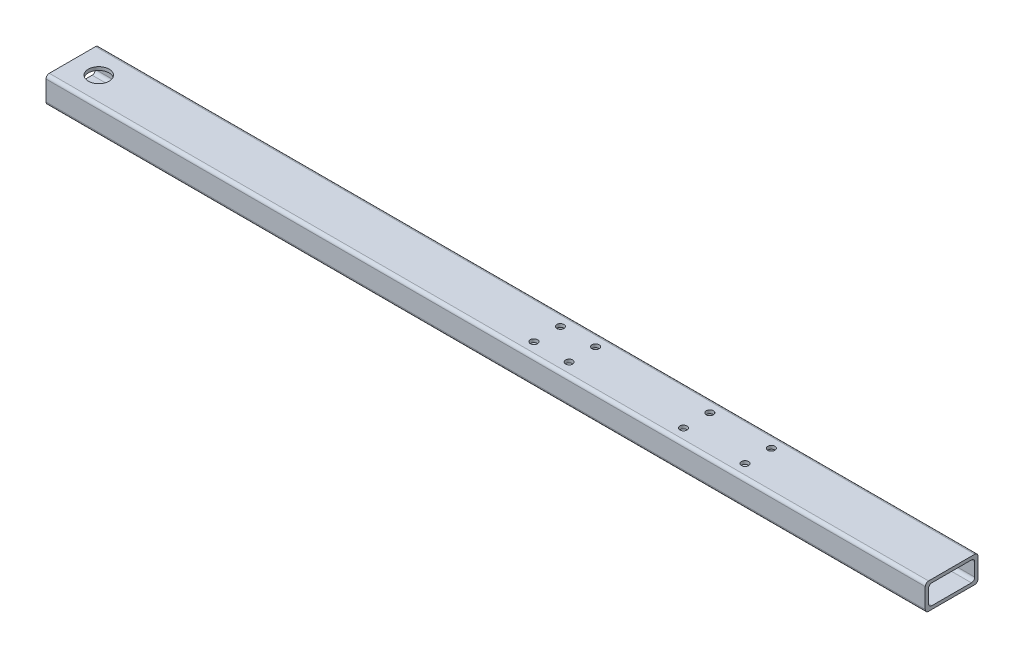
from build123d import *

# Parameters (mm, degrees)
SKETCH1_W           = 2540
SKETCH1_H           = 152.4
EXTRUDE1_DEPTH      = 76.2
SKETCH3_W           = 133.35
SKETCH3_H           = 57.15
CUT_EXTRUDE1_DEPTH  = 2540
FILLET1_R           = 9.525
SKETCH4_R           = 30.1625
CUT_EXTRUDE2_DEPTH  = 76.2
SKETCH5_R           = 10.31875
CUT_EXTRUDE8_DEPTH  = 76.2
SKETCH6_R           = 10.31875
CUT_EXTRUDE9_DEPTH  = 76.2
SKETCH7_R           = 10.31875
CUT_EXTRUDE10_DEPTH = 76.2
SKETCH8_R           = 10.31875
CUT_EXTRUDE11_DEPTH = 76.2


with BuildPart() as part:
    # Sketch1 → Extrude1 (new body)
    with BuildSketch(Plane(origin=(0, 0, 0), x_dir=(1, 0, 0), z_dir=(0, 1, 0))):
        with Locations((-1270, -76.2)):
            Rectangle(SKETCH1_W, SKETCH1_H)
    extrude(amount=EXTRUDE1_DEPTH)

    # Sketch3 → Cut-Extrude1 (cut)
    with BuildSketch(Plane(origin=(0, 0, 0), x_dir=(0, 0, -1), z_dir=(1, 0, 0))):
        with Locations((-76.2, 38.1)):
            Rectangle(SKETCH3_W, SKETCH3_H)
    extrude(amount=-CUT_EXTRUDE1_DEPTH, mode=Mode.SUBTRACT)

    # Fillet1
    fillet1_edges = [part.edges().sort_by_distance(p)[0] for p in [
        (-1270, 76.2, 152.4),
        (-1270, 66.675, 9.525),
        (-1270, 9.525, 9.525),
        (-1270, 9.525, 142.875),
        (-1270, 66.675, 142.875),
        (-1270, 0, 152.4),
        (-1270, 0, 0),
        (-1270, 76.2, 0),
    ]]
    fillet(fillet1_edges, radius=FILLET1_R)

    # Sketch4 → Cut-Extrude2 (cut)
    with BuildSketch(Plane(origin=(0, 76.2, 0), x_dir=(1, 0, 0), z_dir=(0, 1, 0))):
        with Locations(Location((-2463.8, -76.2, 0), (0, 0, 270))):
            Circle(SKETCH4_R)
    extrude(amount=-CUT_EXTRUDE2_DEPTH, mode=Mode.SUBTRACT)

    # Sketch5 → Cut-Extrude8 (cut)
    with BuildSketch(Plane(origin=(0, 76.2, 0), x_dir=(1, 0, 0), z_dir=(0, 1, 0))):
        with Locations(Location((-1066.8, -38.1, 0), (0, 0, 270))):
            Circle(SKETCH5_R)
    cut_extrude8 = extrude(amount=-CUT_EXTRUDE8_DEPTH, mode=Mode.SUBTRACT)

    # Sketch6 → Cut-Extrude9 (cut)
    with BuildSketch(Plane(origin=(0, 76.2, 0), x_dir=(1, 0, 0), z_dir=(0, 1, 0))):
        with Locations(Location((-1168.4, -38.1, 0), (0, 0, 270))):
            Circle(SKETCH6_R)
    cut_extrude9 = extrude(amount=-CUT_EXTRUDE9_DEPTH, mode=Mode.SUBTRACT)

    # Sketch7 → Cut-Extrude10 (cut)
    with BuildSketch(Plane(origin=(0, 76.2, 0), x_dir=(1, 0, 0), z_dir=(0, 1, 0))):
        with Locations(Location((-736.6, -38.1, 0), (0, 0, 270))):
            Circle(SKETCH7_R)
    cut_extrude10 = extrude(amount=-CUT_EXTRUDE10_DEPTH, mode=Mode.SUBTRACT)

    # Sketch8 → Cut-Extrude11 (cut)
    with BuildSketch(Plane(origin=(0, 76.2, 0), x_dir=(1, 0, 0), z_dir=(0, 1, 0))):
        with Locations(Location((-558.8, -38.1, 0), (0, 0, 270))):
            Circle(SKETCH8_R)
    cut_extrude11 = extrude(amount=-CUT_EXTRUDE11_DEPTH, mode=Mode.SUBTRACT)

    # Mirror1: Cut-Extrude8, Cut-Extrude9, Cut-Extrude10, Cut-Extrude11 across plane
    add(cut_extrude8.mirror(Plane.XY.offset(76.2)), mode=Mode.SUBTRACT)
    add(cut_extrude9.mirror(Plane.XY.offset(76.2)), mode=Mode.SUBTRACT)
    add(cut_extrude10.mirror(Plane.XY.offset(76.2)), mode=Mode.SUBTRACT)
    add(cut_extrude11.mirror(Plane.XY.offset(76.2)), mode=Mode.SUBTRACT)


solid = part.part
